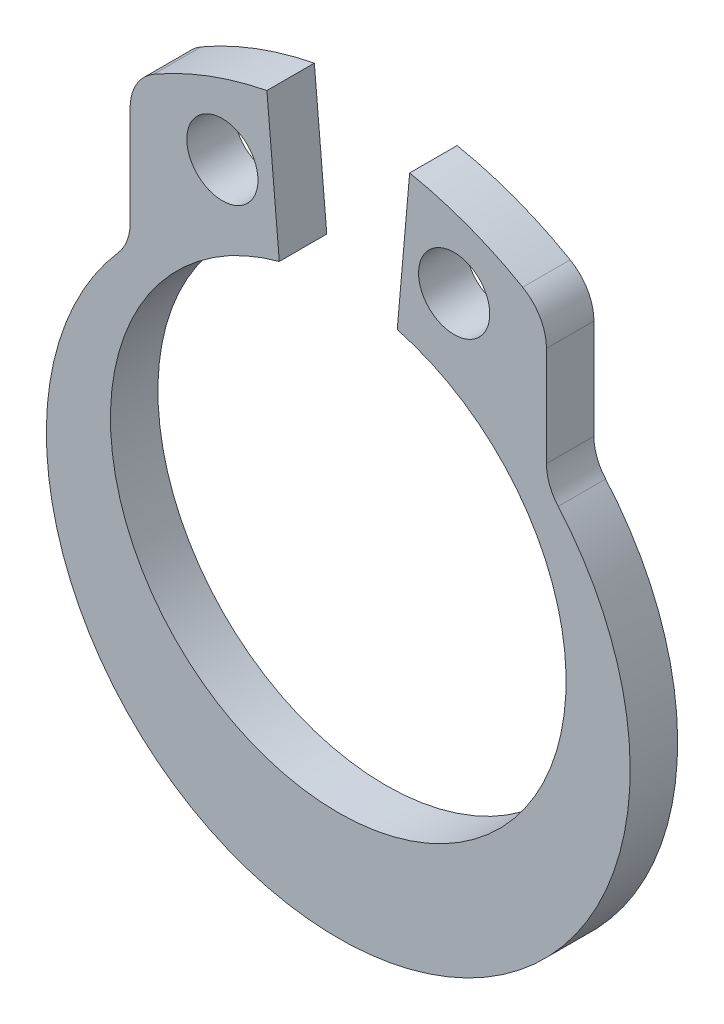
from build123d import *

# Parameters (mm, degrees)
SKETCH1_R          = 0.75
BASE_EXTRUDE_DEPTH = 1


with BuildPart() as part:
    # Sketch1 → Base-Extrude (new body)
    with BuildSketch(Plane.XY):
        with BuildLine():
            Line((-4.385951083, 6.804439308), (-4.385951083, 4.702555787))
            ThreePointArc((-4.385951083, 4.702555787), (-4.449660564, 4.351329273), (-4.632671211, 4.044855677))
            ThreePointArc((-4.632671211, 4.044855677), (0, -6.15), (4.632671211, 4.044855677))
            ThreePointArc((4.632671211, 4.044855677), (4.449660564, 4.351329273), (4.385951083, 4.702555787))
            Line((4.385951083, 4.702555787), (4.385951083, 6.804439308))
            ThreePointArc((4.385951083, 6.804439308), (4.251976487, 7.304439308), (3.885951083, 7.670464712))
            ThreePointArc((3.885951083, 7.670464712), (2.731725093, 8.215797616), (1.503798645, 8.56482806))
            Line((1.503798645, 8.56482806), (1.242331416, 5.576243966))
            ThreePointArc((1.242331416, 5.576243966), (0, -3.8602), (-1.242331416, 5.576243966))
            Line((-1.242331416, 5.576243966), (-1.503798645, 8.56482806))
            ThreePointArc((-1.503798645, 8.56482806), (-2.731725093, 8.215797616), (-3.885951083, 7.670464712))
            ThreePointArc((-3.885951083, 7.670464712), (-4.251976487, 7.304439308), (-4.385951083, 6.804439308))
        make_face()
        with Locations((-2.441520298, 6.834151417)):
            Circle(SKETCH1_R, mode=Mode.SUBTRACT)
        with Locations((2.441520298, 6.834151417)):
            Circle(SKETCH1_R, mode=Mode.SUBTRACT)
    extrude(amount=BASE_EXTRUDE_DEPTH)


solid = part.part
